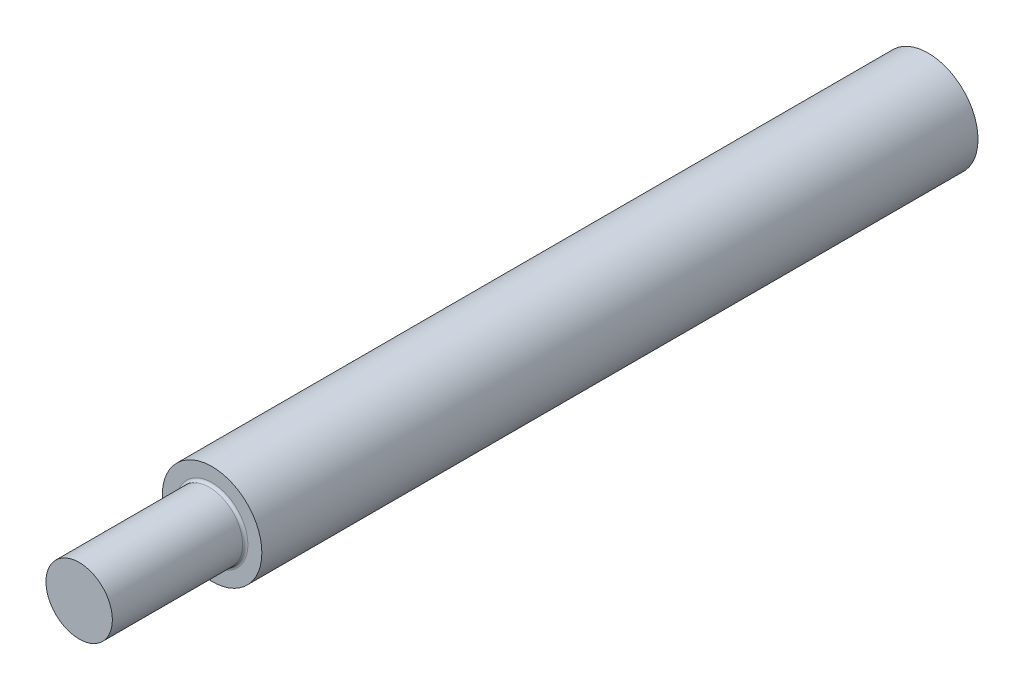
from build123d import *

# Parameters (mm, degrees)
SKETCH1_R           = 4.7625
BOSS_EXTRUDE1_DEPTH = 68.453
SKETCH2_R           = 3.175
BOSS_EXTRUDE2_DEPTH = 12.7
FILLET1_R           = 0.254


with BuildPart() as part:
    # Sketch1 → Boss-Extrude1 (new body)
    with BuildSketch(Plane.XY):
        Circle(SKETCH1_R)
    extrude(amount=BOSS_EXTRUDE1_DEPTH)

    # Sketch2 → Boss-Extrude2 (add)
    with BuildSketch(Plane.XY.offset(68.453)):
        Circle(SKETCH2_R)
    extrude(amount=BOSS_EXTRUDE2_DEPTH)

    # Fillet1
    fillet1_edges = [part.edges().sort_by_distance(p)[0] for p in [
        (-3.175, 0, 68.453),
    ]]
    fillet(fillet1_edges, radius=FILLET1_R)


solid = part.part
